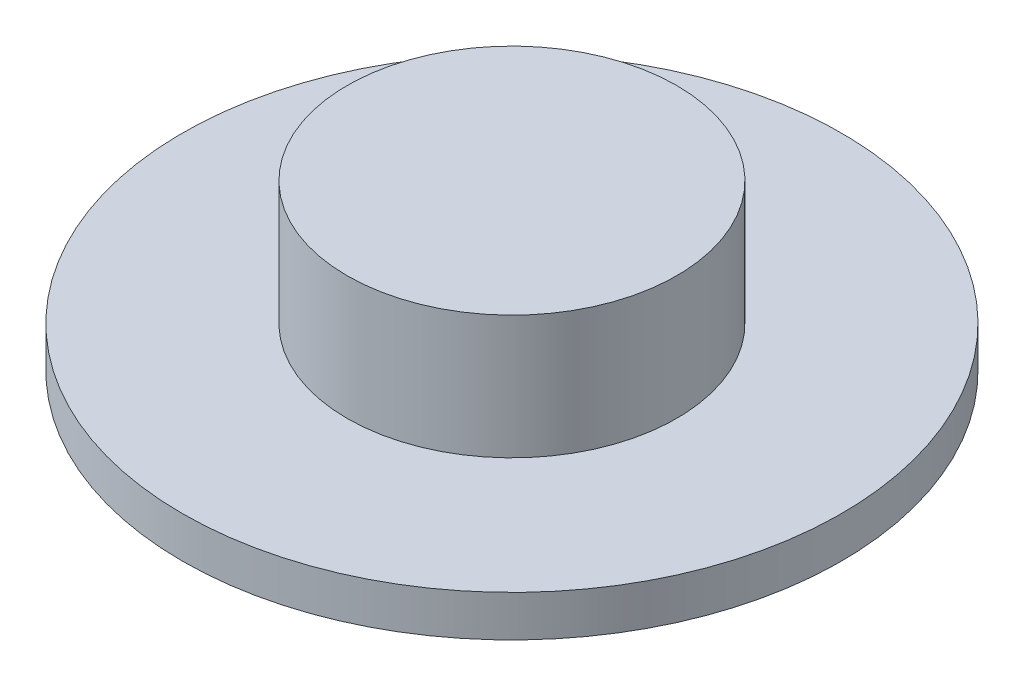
ISO-10303-21;
HEADER;
FILE_DESCRIPTION(('STEP AP214'),'2;1');
FILE_NAME('part.step','',(''),(''),'','','');
FILE_SCHEMA(('AUTOMOTIVE_DESIGN { 1 0 10303 214 1 1 1 1 }'));
ENDSEC;
DATA;
#1=APPLICATION_CONTEXT('core data for automotive mechanical design processes');
#2=APPLICATION_PROTOCOL_DEFINITION('international standard','automotive_design',2000,#1);
#3=PRODUCT_CONTEXT('',#1,'mechanical');
#4=PRODUCT('Part','Part','',(#3));
#5=PRODUCT_RELATED_PRODUCT_CATEGORY('part','',(#4));
#6=PRODUCT_DEFINITION_FORMATION('','',#4);
#7=PRODUCT_DEFINITION_CONTEXT('part definition',#1,'design');
#8=PRODUCT_DEFINITION('design','',#6,#7);
#9=PRODUCT_DEFINITION_SHAPE('','',#8);
#10=(LENGTH_UNIT() NAMED_UNIT(*) SI_UNIT(.MILLI.,.METRE.));
#11=(NAMED_UNIT(*) PLANE_ANGLE_UNIT() SI_UNIT($,.RADIAN.));
#12=(NAMED_UNIT(*) SI_UNIT($,.STERADIAN.) SOLID_ANGLE_UNIT());
#13=UNCERTAINTY_MEASURE_WITH_UNIT(LENGTH_MEASURE(1.E-05),#10,'distance_accuracy_value','');
#14=(GEOMETRIC_REPRESENTATION_CONTEXT(3) GLOBAL_UNCERTAINTY_ASSIGNED_CONTEXT((#13)) GLOBAL_UNIT_ASSIGNED_CONTEXT((#10,
#11,#12)) REPRESENTATION_CONTEXT('',''));
#15=CARTESIAN_POINT('',(0.,0.,0.));
#16=DIRECTION('',(0.,0.,1.));
#17=DIRECTION('',(1.,0.,0.));
#18=AXIS2_PLACEMENT_3D('',#15,#16,#17);
#19=CARTESIAN_POINT('',(0.,10.,0.));
#20=DIRECTION('',(0.,-1.,0.));
#21=DIRECTION('',(0.,0.,-1.));
#22=AXIS2_PLACEMENT_3D('',#19,#20,#21);
#23=CYLINDRICAL_SURFACE('',#22,80.);
#24=CARTESIAN_POINT('',(0.,10.,0.));
#25=DIRECTION('',(0.,1.,0.));
#26=DIRECTION('',(0.,0.,1.));
#27=AXIS2_PLACEMENT_3D('',#24,#25,#26);
#28=CIRCLE('',#27,80.);
#29=CARTESIAN_POINT('',(0.,10.,80.));
#30=VERTEX_POINT('',#29);
#31=EDGE_CURVE('E10',#30,#30,#28,.T.);
#32=ORIENTED_EDGE('',*,*,#31,.F.);
#33=EDGE_LOOP('',(#32));
#34=FACE_BOUND('',#33,.T.);
#35=CARTESIAN_POINT('',(0.,0.,0.));
#36=DIRECTION('',(0.,1.,0.));
#37=DIRECTION('',(0.,0.,1.));
#38=AXIS2_PLACEMENT_3D('',#35,#36,#37);
#39=CIRCLE('',#38,80.);
#40=CARTESIAN_POINT('',(0.,0.,80.));
#41=VERTEX_POINT('',#40);
#42=EDGE_CURVE('E38',#41,#41,#39,.T.);
#43=ORIENTED_EDGE('',*,*,#42,.T.);
#44=EDGE_LOOP('',(#43));
#45=FACE_BOUND('',#44,.T.);
#46=ADVANCED_FACE('F35',(#34,#45),#23,.T.);
#47=CARTESIAN_POINT('',(0.,10.,0.));
#48=DIRECTION('',(0.,1.,0.));
#49=DIRECTION('',(0.,0.,1.));
#50=AXIS2_PLACEMENT_3D('',#47,#48,#49);
#51=PLANE('',#50);
#52=CARTESIAN_POINT('',(0.,10.,0.));
#53=DIRECTION('',(0.,1.,0.));
#54=DIRECTION('',(0.,0.,1.));
#55=AXIS2_PLACEMENT_3D('',#52,#53,#54);
#56=CIRCLE('',#55,40.);
#57=CARTESIAN_POINT('',(0.,10.,40.));
#58=VERTEX_POINT('',#57);
#59=EDGE_CURVE('E47',#58,#58,#56,.F.);
#60=ORIENTED_EDGE('',*,*,#59,.T.);
#61=EDGE_LOOP('',(#60));
#62=FACE_BOUND('',#61,.T.);
#63=ORIENTED_EDGE('',*,*,#31,.T.);
#64=EDGE_LOOP('',(#63));
#65=FACE_BOUND('',#64,.T.);
#66=ADVANCED_FACE('F67',(#62,#65),#51,.T.);
#67=CARTESIAN_POINT('',(0.,0.,0.));
#68=DIRECTION('',(0.,1.,0.));
#69=DIRECTION('',(0.,0.,1.));
#70=AXIS2_PLACEMENT_3D('',#67,#68,#69);
#71=PLANE('',#70);
#72=ORIENTED_EDGE('',*,*,#42,.F.);
#73=EDGE_LOOP('',(#72));
#74=FACE_BOUND('',#73,.T.);
#75=ADVANCED_FACE('F59',(#74),#71,.F.);
#76=CARTESIAN_POINT('',(0.,40.,0.));
#77=DIRECTION('',(0.,-1.,0.));
#78=DIRECTION('',(0.,0.,-1.));
#79=AXIS2_PLACEMENT_3D('',#76,#77,#78);
#80=CYLINDRICAL_SURFACE('',#79,40.);
#81=ORIENTED_EDGE('',*,*,#59,.F.);
#82=EDGE_LOOP('',(#81));
#83=FACE_BOUND('',#82,.T.);
#84=CARTESIAN_POINT('',(0.,40.,0.));
#85=DIRECTION('',(0.,1.,0.));
#86=DIRECTION('',(0.,0.,1.));
#87=AXIS2_PLACEMENT_3D('',#84,#85,#86);
#88=CIRCLE('',#87,40.);
#89=CARTESIAN_POINT('',(0.,40.,40.));
#90=VERTEX_POINT('',#89);
#91=EDGE_CURVE('E51',#90,#90,#88,.T.);
#92=ORIENTED_EDGE('',*,*,#91,.F.);
#93=EDGE_LOOP('',(#92));
#94=FACE_BOUND('',#93,.T.);
#95=ADVANCED_FACE('F57',(#83,#94),#80,.T.);
#96=CARTESIAN_POINT('',(0.,40.,0.));
#97=DIRECTION('',(0.,1.,0.));
#98=DIRECTION('',(0.,0.,1.));
#99=AXIS2_PLACEMENT_3D('',#96,#97,#98);
#100=PLANE('',#99);
#101=ORIENTED_EDGE('',*,*,#91,.T.);
#102=EDGE_LOOP('',(#101));
#103=FACE_BOUND('',#102,.T.);
#104=ADVANCED_FACE('F55',(#103),#100,.T.);
#105=CLOSED_SHELL('',(#46,#66,#75,#95,#104));
#106=MANIFOLD_SOLID_BREP('B2',#105);
#107=ADVANCED_BREP_SHAPE_REPRESENTATION('',(#18,#106),#14);
#108=SHAPE_DEFINITION_REPRESENTATION(#9,#107);
ENDSEC;
END-ISO-10303-21;
